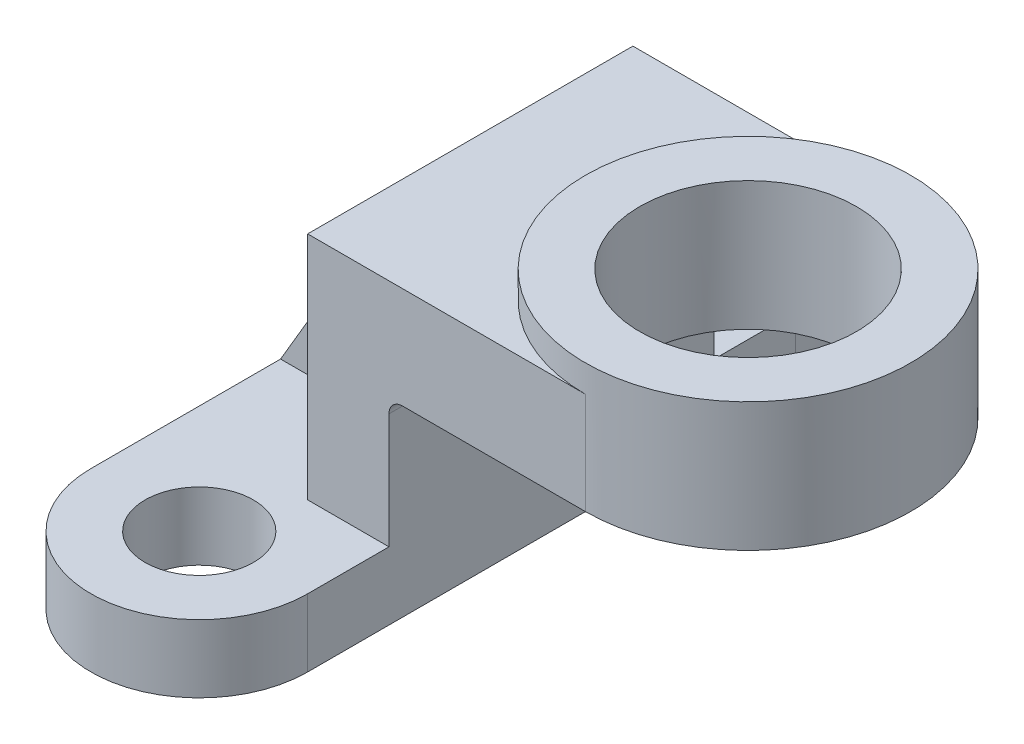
from build123d import *

# Parameters (mm, degrees)
SKETCH2_R                = 16
SKETCH2_R_2              = 8
BOSS_EXTRUDE1_DEPTH      = 10
BOSS_EXTRUDE2_DEPTH      = 24
BOSS_EXTRUDE2_DEPTH_BACK = 24
BOSS_EXTRUDE3_DEPTH      = 4
BOSS_EXTRUDE3_DEPTH_BACK = 15
SKETCH4_R                = 24
CUT_EXTRUDE1_DEPTH       = 10
CUT_EXTRUDE1_DEPTH_BACK  = 25
SKETCH5_R                = 16
RIB8_REACH               = 100.838
SKETCH8_WALL_W           = 239.122669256
SKETCH8_WALL_H           = 16


with BuildPart() as part:
    # Sketch2 → Boss-Extrude1 (new body)
    # profile 1 of 4: a face of its own
    with BuildSketch(Plane(origin=(0, 0, 0), x_dir=(1, 0, 0), z_dir=(0, 1, 0))):
        with Locations((0, 36)):
            Circle(SKETCH2_R)
        with Locations(Location((0, 36, 0), (0, 0, 270))):
            Circle(SKETCH2_R_2, mode=Mode.SUBTRACT)
    # profile 2 of 4: a face of its own
    with BuildSketch(Plane(origin=(0, 0, 0), x_dir=(1, 0, 0), z_dir=(0, 1, 0))):
        with BuildLine():
            Line((16, 0), (-16, 0))
            Line((-16, 0), (-16, -36))
            ThreePointArc((-16, -36), (0, -20), (16, -36))
            Line((16, -36), (16, 0))
        make_face()
    # profile 3 of 4: a face of its own
    with BuildSketch(Plane(origin=(0, 0, 0), x_dir=(1, 0, 0), z_dir=(0, 1, 0))):
        with BuildLine():
            ThreePointArc((16, 36), (0, 20), (-16, 36))
            Line((-16, 36), (-16, 0))
            Line((-16, 0), (16, 0))
            Line((16, 0), (16, 36))
        make_face()
    # profile 4 of 4: a face of its own
    with BuildSketch(Plane(origin=(0, 0, 0), x_dir=(1, 0, 0), z_dir=(0, 1, 0))):
        with Locations((0, -36)):
            Circle(SKETCH2_R)
        with Locations(Location((0, -36, 0), (0, 0, 270))):
            Circle(SKETCH2_R_2, mode=Mode.SUBTRACT)
    extrude(amount=BOSS_EXTRUDE1_DEPTH)

    # Sketch3 → Boss-Extrude2 (add, two sides: drawn at the far end of the back side and taken through both)
    with BuildSketch(Plane.XY.offset(-BOSS_EXTRUDE2_DEPTH_BACK)):
        with BuildLine():
            Line((16, 10), (16, 27))
            ThreePointArc((16, 27), (16.585786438, 28.414213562), (18, 29))
            Line((18, 29), (45, 29))
            Line((45, 29), (45, 44))
            Line((45, 44), (4, 44))
            Line((4, 44), (4, 10))
            Line((4, 10), (16, 10))
        make_face()
    extrude(amount=BOSS_EXTRUDE2_DEPTH + BOSS_EXTRUDE2_DEPTH_BACK)

    # Sketch4 → Boss-Extrude3 (add, two sides: drawn at the far end of the back side and taken through both)
    with BuildSketch(Plane(origin=(0, 44, 0), x_dir=(1, 0, 0), z_dir=(0, 1, 0)).offset(-BOSS_EXTRUDE3_DEPTH_BACK)):
        with Locations(Location((45, 0, 0), (0, 0, 180))):
            Circle(SKETCH4_R)
    extrude(amount=BOSS_EXTRUDE3_DEPTH + BOSS_EXTRUDE3_DEPTH_BACK)

    # Sketch5 → Cut-Extrude1 (cut, two sides: drawn at the far end of the back side and taken through both)
    with BuildSketch(Plane(origin=(0, 48, 0), x_dir=(1, 0, 0), z_dir=(0, 1, 0)).offset(-CUT_EXTRUDE1_DEPTH_BACK)):
        with Locations(Location((45, 0, 0), (0, 0, 90))):
            Circle(SKETCH5_R)
    extrude(amount=CUT_EXTRUDE1_DEPTH + CUT_EXTRUDE1_DEPTH_BACK, mode=Mode.SUBTRACT)

    # Sketch8 wall → Rib8 (add, up to next)
    with BuildSketch(Plane(origin=(-6, 27, 0), x_dir=(-0.507020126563, -0.861934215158, 0), z_dir=(0.861934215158, -0.507020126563, 0)), mode=Mode.PRIVATE) as rib8_sk1:
        Rectangle(SKETCH8_WALL_W, SKETCH8_WALL_H)
    rib8_tool1 = extrude(rib8_sk1.sketch, amount=RIB8_REACH, mode=Mode.PRIVATE) - part.part
    add(rib8_tool1.solids().sort_by_distance((-6, 27, 0))[0])


solid = part.part
